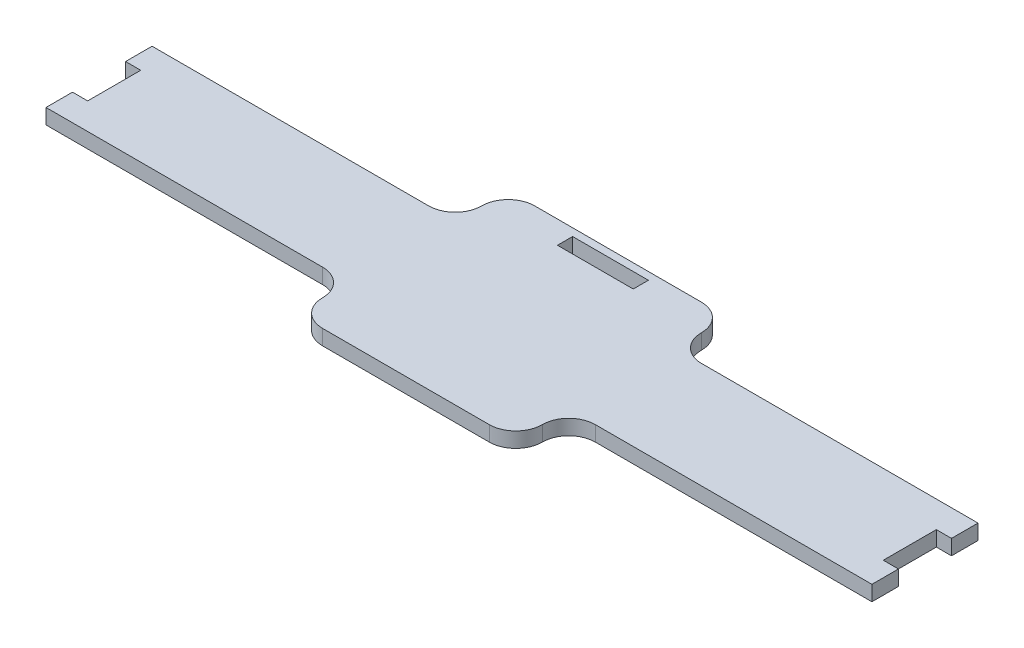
ISO-10303-21;
HEADER;
FILE_DESCRIPTION(('STEP AP214'),'2;1');
FILE_NAME('part.step','',(''),(''),'','','');
FILE_SCHEMA(('AUTOMOTIVE_DESIGN { 1 0 10303 214 1 1 1 1 }'));
ENDSEC;
DATA;
#1=APPLICATION_CONTEXT('core data for automotive mechanical design processes');
#2=APPLICATION_PROTOCOL_DEFINITION('international standard','automotive_design',2000,#1);
#3=PRODUCT_CONTEXT('',#1,'mechanical');
#4=PRODUCT('Part','Part','',(#3));
#5=PRODUCT_RELATED_PRODUCT_CATEGORY('part','',(#4));
#6=PRODUCT_DEFINITION_FORMATION('','',#4);
#7=PRODUCT_DEFINITION_CONTEXT('part definition',#1,'design');
#8=PRODUCT_DEFINITION('design','',#6,#7);
#9=PRODUCT_DEFINITION_SHAPE('','',#8);
#10=(LENGTH_UNIT() NAMED_UNIT(*) SI_UNIT(.MILLI.,.METRE.));
#11=(NAMED_UNIT(*) PLANE_ANGLE_UNIT() SI_UNIT($,.RADIAN.));
#12=(NAMED_UNIT(*) SI_UNIT($,.STERADIAN.) SOLID_ANGLE_UNIT());
#13=UNCERTAINTY_MEASURE_WITH_UNIT(LENGTH_MEASURE(1.E-05),#10,'distance_accuracy_value','');
#14=(GEOMETRIC_REPRESENTATION_CONTEXT(3) GLOBAL_UNCERTAINTY_ASSIGNED_CONTEXT((#13)) GLOBAL_UNIT_ASSIGNED_CONTEXT((#10,
#11,#12)) REPRESENTATION_CONTEXT('',''));
#15=CARTESIAN_POINT('',(0.,0.,0.));
#16=DIRECTION('',(0.,0.,1.));
#17=DIRECTION('',(1.,0.,0.));
#18=AXIS2_PLACEMENT_3D('',#15,#16,#17);
#19=CARTESIAN_POINT('',(0.,2.,0.));
#20=DIRECTION('',(0.,1.,0.));
#21=DIRECTION('',(0.,0.,1.));
#22=AXIS2_PLACEMENT_3D('',#19,#20,#21);
#23=PLANE('',#22);
#24=DIRECTION('',(-1.,0.,0.));
#25=VECTOR('',#24,1.);
#26=CARTESIAN_POINT('',(-5.,2.,-13.));
#27=LINE('',#26,#25);
#28=CARTESIAN_POINT('',(5.,2.,-13.));
#29=VERTEX_POINT('',#28);
#30=CARTESIAN_POINT('',(-5.,2.,-13.));
#31=VERTEX_POINT('',#30);
#32=EDGE_CURVE('E305',#29,#31,#27,.T.);
#33=ORIENTED_EDGE('',*,*,#32,.F.);
#34=DIRECTION('',(0.,0.,-1.));
#35=VECTOR('',#34,1.);
#36=CARTESIAN_POINT('',(4.99999999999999,2.,-11.));
#37=LINE('',#36,#35);
#38=CARTESIAN_POINT('',(4.99999999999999,2.,-11.));
#39=VERTEX_POINT('',#38);
#40=EDGE_CURVE('E302',#39,#29,#37,.T.);
#41=ORIENTED_EDGE('',*,*,#40,.F.);
#42=DIRECTION('',(1.,0.,0.));
#43=VECTOR('',#42,1.);
#44=CARTESIAN_POINT('',(-5.00000000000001,2.,-11.));
#45=LINE('',#44,#43);
#46=CARTESIAN_POINT('',(-5.00000000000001,2.,-11.));
#47=VERTEX_POINT('',#46);
#48=EDGE_CURVE('E313',#47,#39,#45,.T.);
#49=ORIENTED_EDGE('',*,*,#48,.F.);
#50=DIRECTION('',(0.,0.,1.));
#51=VECTOR('',#50,1.);
#52=CARTESIAN_POINT('',(-5.00000000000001,2.,-11.));
#53=LINE('',#52,#51);
#54=EDGE_CURVE('E309',#31,#47,#53,.T.);
#55=ORIENTED_EDGE('',*,*,#54,.F.);
#56=EDGE_LOOP('',(#33,#41,#49,#55));
#57=FACE_BOUND('',#56,.T.);
#58=DIRECTION('',(0.,0.,-1.));
#59=VECTOR('',#58,1.);
#60=CARTESIAN_POINT('',(-52.5,2.,3.5));
#61=LINE('',#60,#59);
#62=CARTESIAN_POINT('',(-52.5,2.,3.5));
#63=VERTEX_POINT('',#62);
#64=CARTESIAN_POINT('',(-52.5,2.,-3.5));
#65=VERTEX_POINT('',#64);
#66=EDGE_CURVE('E240',#63,#65,#61,.T.);
#67=ORIENTED_EDGE('',*,*,#66,.F.);
#68=DIRECTION('',(1.,0.,0.));
#69=VECTOR('',#68,1.);
#70=CARTESIAN_POINT('',(-54.5,2.,3.5));
#71=LINE('',#70,#69);
#72=CARTESIAN_POINT('',(-54.5,2.,3.5));
#73=VERTEX_POINT('',#72);
#74=EDGE_CURVE('E247',#73,#63,#71,.T.);
#75=ORIENTED_EDGE('',*,*,#74,.F.);
#76=DIRECTION('',(0.,0.,1.));
#77=VECTOR('',#76,1.);
#78=CARTESIAN_POINT('',(-54.5,2.,-6.99999999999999));
#79=LINE('',#78,#77);
#80=CARTESIAN_POINT('',(-54.5,2.,7.00000000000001));
#81=VERTEX_POINT('',#80);
#82=EDGE_CURVE('E355',#73,#81,#79,.T.);
#83=ORIENTED_EDGE('',*,*,#82,.T.);
#84=DIRECTION('',(1.,0.,0.));
#85=VECTOR('',#84,1.);
#86=CARTESIAN_POINT('',(-14.5,2.,7.00000000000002));
#87=LINE('',#86,#85);
#88=CARTESIAN_POINT('',(-18.,2.,7.00000000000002));
#89=VERTEX_POINT('',#88);
#90=EDGE_CURVE('E358',#81,#89,#87,.T.);
#91=ORIENTED_EDGE('',*,*,#90,.T.);
#92=CARTESIAN_POINT('',(-18.,2.,10.5));
#93=DIRECTION('',(0.,1.,0.));
#94=DIRECTION('',(0.,0.,1.));
#95=AXIS2_PLACEMENT_3D('',#92,#93,#94);
#96=CIRCLE('',#95,3.5);
#97=CARTESIAN_POINT('',(-14.5,2.,10.5));
#98=VERTEX_POINT('',#97);
#99=EDGE_CURVE('E491',#89,#98,#96,.F.);
#100=ORIENTED_EDGE('',*,*,#99,.T.);
#101=CARTESIAN_POINT('',(-11.,2.,10.5));
#102=DIRECTION('',(0.,1.,0.));
#103=DIRECTION('',(0.,0.,1.));
#104=AXIS2_PLACEMENT_3D('',#101,#102,#103);
#105=CIRCLE('',#104,3.5);
#106=CARTESIAN_POINT('',(-11.,2.,14.));
#107=VERTEX_POINT('',#106);
#108=EDGE_CURVE('E450',#98,#107,#105,.T.);
#109=ORIENTED_EDGE('',*,*,#108,.T.);
#110=DIRECTION('',(1.,0.,0.));
#111=VECTOR('',#110,1.);
#112=CARTESIAN_POINT('',(-14.5,2.,14.));
#113=LINE('',#112,#111);
#114=CARTESIAN_POINT('',(11.,2.,14.));
#115=VERTEX_POINT('',#114);
#116=EDGE_CURVE('E362',#107,#115,#113,.T.);
#117=ORIENTED_EDGE('',*,*,#116,.T.);
#118=CARTESIAN_POINT('',(11.,2.,10.5));
#119=DIRECTION('',(0.,1.,0.));
#120=DIRECTION('',(0.,0.,1.));
#121=AXIS2_PLACEMENT_3D('',#118,#119,#120);
#122=CIRCLE('',#121,3.5);
#123=CARTESIAN_POINT('',(14.5,2.,10.5));
#124=VERTEX_POINT('',#123);
#125=EDGE_CURVE('E447',#115,#124,#122,.T.);
#126=ORIENTED_EDGE('',*,*,#125,.T.);
#127=CARTESIAN_POINT('',(18.,2.,10.5));
#128=DIRECTION('',(0.,1.,0.));
#129=DIRECTION('',(0.,0.,1.));
#130=AXIS2_PLACEMENT_3D('',#127,#128,#129);
#131=CIRCLE('',#130,3.5);
#132=CARTESIAN_POINT('',(18.,2.,7.00000000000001));
#133=VERTEX_POINT('',#132);
#134=EDGE_CURVE('E11',#124,#133,#131,.F.);
#135=ORIENTED_EDGE('',*,*,#134,.T.);
#136=DIRECTION('',(1.,0.,0.));
#137=VECTOR('',#136,1.);
#138=CARTESIAN_POINT('',(14.5,2.,7.00000000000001));
#139=LINE('',#138,#137);
#140=CARTESIAN_POINT('',(54.5,2.,7.));
#141=VERTEX_POINT('',#140);
#142=EDGE_CURVE('E366',#133,#141,#139,.T.);
#143=ORIENTED_EDGE('',*,*,#142,.T.);
#144=DIRECTION('',(0.,0.,-1.));
#145=VECTOR('',#144,1.);
#146=CARTESIAN_POINT('',(54.5,2.,-7.));
#147=LINE('',#146,#145);
#148=CARTESIAN_POINT('',(54.5,2.,3.5));
#149=VERTEX_POINT('',#148);
#150=EDGE_CURVE('E370',#141,#149,#147,.T.);
#151=ORIENTED_EDGE('',*,*,#150,.T.);
#152=DIRECTION('',(1.,0.,0.));
#153=VECTOR('',#152,1.);
#154=CARTESIAN_POINT('',(54.5,2.,3.5));
#155=LINE('',#154,#153);
#156=CARTESIAN_POINT('',(52.5,2.,3.5));
#157=VERTEX_POINT('',#156);
#158=EDGE_CURVE('E287',#157,#149,#155,.T.);
#159=ORIENTED_EDGE('',*,*,#158,.F.);
#160=DIRECTION('',(0.,0.,1.));
#161=VECTOR('',#160,1.);
#162=CARTESIAN_POINT('',(52.5,2.,3.5));
#163=LINE('',#162,#161);
#164=CARTESIAN_POINT('',(52.5,2.,-3.5));
#165=VERTEX_POINT('',#164);
#166=EDGE_CURVE('E283',#165,#157,#163,.T.);
#167=ORIENTED_EDGE('',*,*,#166,.F.);
#168=DIRECTION('',(-1.,0.,0.));
#169=VECTOR('',#168,1.);
#170=CARTESIAN_POINT('',(54.5,2.,-3.5));
#171=LINE('',#170,#169);
#172=CARTESIAN_POINT('',(54.5,2.,-3.5));
#173=VERTEX_POINT('',#172);
#174=EDGE_CURVE('E290',#173,#165,#171,.T.);
#175=ORIENTED_EDGE('',*,*,#174,.F.);
#176=CARTESIAN_POINT('',(54.5,2.,-7.));
#177=VERTEX_POINT('',#176);
#178=EDGE_CURVE('E369',#173,#177,#147,.T.);
#179=ORIENTED_EDGE('',*,*,#178,.T.);
#180=DIRECTION('',(-1.,0.,0.));
#181=VECTOR('',#180,1.);
#182=CARTESIAN_POINT('',(14.5,2.,-7.));
#183=LINE('',#182,#181);
#184=CARTESIAN_POINT('',(18.,2.,-7.));
#185=VERTEX_POINT('',#184);
#186=EDGE_CURVE('E374',#177,#185,#183,.T.);
#187=ORIENTED_EDGE('',*,*,#186,.T.);
#188=CARTESIAN_POINT('',(18.,2.,-10.5));
#189=DIRECTION('',(0.,1.,0.));
#190=DIRECTION('',(0.,0.,1.));
#191=AXIS2_PLACEMENT_3D('',#188,#189,#190);
#192=CIRCLE('',#191,3.5);
#193=CARTESIAN_POINT('',(14.5,2.,-10.5));
#194=VERTEX_POINT('',#193);
#195=EDGE_CURVE('E485',#185,#194,#192,.F.);
#196=ORIENTED_EDGE('',*,*,#195,.T.);
#197=CARTESIAN_POINT('',(11.,2.,-10.5));
#198=DIRECTION('',(0.,1.,0.));
#199=DIRECTION('',(0.,0.,1.));
#200=AXIS2_PLACEMENT_3D('',#197,#198,#199);
#201=CIRCLE('',#200,3.5);
#202=CARTESIAN_POINT('',(11.,2.,-14.));
#203=VERTEX_POINT('',#202);
#204=EDGE_CURVE('E453',#194,#203,#201,.T.);
#205=ORIENTED_EDGE('',*,*,#204,.T.);
#206=DIRECTION('',(-1.,0.,0.));
#207=VECTOR('',#206,1.);
#208=CARTESIAN_POINT('',(-14.5,2.,-14.));
#209=LINE('',#208,#207);
#210=CARTESIAN_POINT('',(-11.,2.,-14.));
#211=VERTEX_POINT('',#210);
#212=EDGE_CURVE('E347',#203,#211,#209,.T.);
#213=ORIENTED_EDGE('',*,*,#212,.T.);
#214=CARTESIAN_POINT('',(-11.,2.,-10.5));
#215=DIRECTION('',(0.,1.,0.));
#216=DIRECTION('',(0.,0.,1.));
#217=AXIS2_PLACEMENT_3D('',#214,#215,#216);
#218=CIRCLE('',#217,3.5);
#219=CARTESIAN_POINT('',(-14.5,2.,-10.5));
#220=VERTEX_POINT('',#219);
#221=EDGE_CURVE('E456',#211,#220,#218,.T.);
#222=ORIENTED_EDGE('',*,*,#221,.T.);
#223=CARTESIAN_POINT('',(-18.,2.,-10.5));
#224=DIRECTION('',(0.,1.,0.));
#225=DIRECTION('',(0.,0.,1.));
#226=AXIS2_PLACEMENT_3D('',#223,#224,#225);
#227=CIRCLE('',#226,3.5);
#228=CARTESIAN_POINT('',(-18.,2.,-7.));
#229=VERTEX_POINT('',#228);
#230=EDGE_CURVE('E479',#220,#229,#227,.F.);
#231=ORIENTED_EDGE('',*,*,#230,.T.);
#232=DIRECTION('',(-1.,0.,0.));
#233=VECTOR('',#232,1.);
#234=CARTESIAN_POINT('',(-14.5,2.,-7.));
#235=LINE('',#234,#233);
#236=CARTESIAN_POINT('',(-54.5,2.,-6.99999999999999));
#237=VERTEX_POINT('',#236);
#238=EDGE_CURVE('E351',#229,#237,#235,.T.);
#239=ORIENTED_EDGE('',*,*,#238,.T.);
#240=CARTESIAN_POINT('',(-54.5,2.,-3.5));
#241=VERTEX_POINT('',#240);
#242=EDGE_CURVE('E251',#237,#241,#79,.T.);
#243=ORIENTED_EDGE('',*,*,#242,.T.);
#244=DIRECTION('',(-1.,0.,0.));
#245=VECTOR('',#244,1.);
#246=CARTESIAN_POINT('',(-54.5,2.,-3.5));
#247=LINE('',#246,#245);
#248=EDGE_CURVE('E61',#65,#241,#247,.T.);
#249=ORIENTED_EDGE('',*,*,#248,.F.);
#250=EDGE_LOOP('',(#67,#75,#83,#91,#100,#109,#117,#126,#135,#143,#151,#159,#167,#175,#179,#187,
#196,#205,#213,#222,#231,#239,#243,#249));
#251=FACE_BOUND('',#250,.T.);
#252=ADVANCED_FACE('F43',(#57,#251),#23,.T.);
#253=CARTESIAN_POINT('',(0.,0.,0.));
#254=DIRECTION('',(0.,1.,0.));
#255=DIRECTION('',(0.,0.,1.));
#256=AXIS2_PLACEMENT_3D('',#253,#254,#255);
#257=PLANE('',#256);
#258=DIRECTION('',(0.,0.,-1.));
#259=VECTOR('',#258,1.);
#260=CARTESIAN_POINT('',(4.99999999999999,0.,-11.));
#261=LINE('',#260,#259);
#262=CARTESIAN_POINT('',(4.99999999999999,0.,-11.));
#263=VERTEX_POINT('',#262);
#264=CARTESIAN_POINT('',(5.,0.,-13.));
#265=VERTEX_POINT('',#264);
#266=EDGE_CURVE('E317',#263,#265,#261,.T.);
#267=ORIENTED_EDGE('',*,*,#266,.T.);
#268=DIRECTION('',(-1.,0.,0.));
#269=VECTOR('',#268,1.);
#270=CARTESIAN_POINT('',(-5.,0.,-13.));
#271=LINE('',#270,#269);
#272=CARTESIAN_POINT('',(-5.,0.,-13.));
#273=VERTEX_POINT('',#272);
#274=EDGE_CURVE('E321',#265,#273,#271,.T.);
#275=ORIENTED_EDGE('',*,*,#274,.T.);
#276=DIRECTION('',(0.,0.,1.));
#277=VECTOR('',#276,1.);
#278=CARTESIAN_POINT('',(-5.00000000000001,0.,-11.));
#279=LINE('',#278,#277);
#280=CARTESIAN_POINT('',(-5.00000000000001,0.,-11.));
#281=VERTEX_POINT('',#280);
#282=EDGE_CURVE('E326',#273,#281,#279,.T.);
#283=ORIENTED_EDGE('',*,*,#282,.T.);
#284=DIRECTION('',(1.,0.,0.));
#285=VECTOR('',#284,1.);
#286=CARTESIAN_POINT('',(-5.00000000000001,0.,-11.));
#287=LINE('',#286,#285);
#288=EDGE_CURVE('E306',#281,#263,#287,.T.);
#289=ORIENTED_EDGE('',*,*,#288,.T.);
#290=EDGE_LOOP('',(#267,#275,#283,#289));
#291=FACE_BOUND('',#290,.T.);
#292=DIRECTION('',(1.,0.,0.));
#293=VECTOR('',#292,1.);
#294=CARTESIAN_POINT('',(-54.5,0.,3.5));
#295=LINE('',#294,#293);
#296=CARTESIAN_POINT('',(-54.5,0.,3.5));
#297=VERTEX_POINT('',#296);
#298=CARTESIAN_POINT('',(-52.5,0.,3.5));
#299=VERTEX_POINT('',#298);
#300=EDGE_CURVE('E263',#297,#299,#295,.T.);
#301=ORIENTED_EDGE('',*,*,#300,.T.);
#302=DIRECTION('',(0.,0.,-1.));
#303=VECTOR('',#302,1.);
#304=CARTESIAN_POINT('',(-52.5,0.,3.5));
#305=LINE('',#304,#303);
#306=CARTESIAN_POINT('',(-52.5,0.,-3.5));
#307=VERTEX_POINT('',#306);
#308=EDGE_CURVE('E237',#299,#307,#305,.T.);
#309=ORIENTED_EDGE('',*,*,#308,.T.);
#310=DIRECTION('',(-1.,0.,0.));
#311=VECTOR('',#310,1.);
#312=CARTESIAN_POINT('',(-54.5,0.,-3.5));
#313=LINE('',#312,#311);
#314=CARTESIAN_POINT('',(-54.5,0.,-3.5));
#315=VERTEX_POINT('',#314);
#316=EDGE_CURVE('E232',#307,#315,#313,.T.);
#317=ORIENTED_EDGE('',*,*,#316,.T.);
#318=DIRECTION('',(0.,0.,1.));
#319=VECTOR('',#318,1.);
#320=CARTESIAN_POINT('',(-54.5,0.,-6.99999999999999));
#321=LINE('',#320,#319);
#322=CARTESIAN_POINT('',(-54.5,0.,-6.99999999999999));
#323=VERTEX_POINT('',#322);
#324=EDGE_CURVE('E386',#323,#315,#321,.T.);
#325=ORIENTED_EDGE('',*,*,#324,.F.);
#326=DIRECTION('',(-1.,0.,0.));
#327=VECTOR('',#326,1.);
#328=CARTESIAN_POINT('',(-14.5,0.,-7.));
#329=LINE('',#328,#327);
#330=CARTESIAN_POINT('',(-18.,0.,-7.));
#331=VERTEX_POINT('',#330);
#332=EDGE_CURVE('E382',#331,#323,#329,.T.);
#333=ORIENTED_EDGE('',*,*,#332,.F.);
#334=CARTESIAN_POINT('',(-18.,0.,-10.5));
#335=DIRECTION('',(0.,1.,0.));
#336=DIRECTION('',(0.,0.,1.));
#337=AXIS2_PLACEMENT_3D('',#334,#335,#336);
#338=CIRCLE('',#337,3.5);
#339=CARTESIAN_POINT('',(-14.5,0.,-10.5));
#340=VERTEX_POINT('',#339);
#341=EDGE_CURVE('E476',#331,#340,#338,.T.);
#342=ORIENTED_EDGE('',*,*,#341,.T.);
#343=CARTESIAN_POINT('',(-11.,0.,-10.5));
#344=DIRECTION('',(0.,1.,0.));
#345=DIRECTION('',(0.,0.,1.));
#346=AXIS2_PLACEMENT_3D('',#343,#344,#345);
#347=CIRCLE('',#346,3.5);
#348=CARTESIAN_POINT('',(-11.,0.,-14.));
#349=VERTEX_POINT('',#348);
#350=EDGE_CURVE('E437',#340,#349,#347,.F.);
#351=ORIENTED_EDGE('',*,*,#350,.T.);
#352=DIRECTION('',(-1.,0.,0.));
#353=VECTOR('',#352,1.);
#354=CARTESIAN_POINT('',(-14.5,0.,-14.));
#355=LINE('',#354,#353);
#356=CARTESIAN_POINT('',(11.,0.,-14.));
#357=VERTEX_POINT('',#356);
#358=EDGE_CURVE('E346',#357,#349,#355,.T.);
#359=ORIENTED_EDGE('',*,*,#358,.F.);
#360=CARTESIAN_POINT('',(11.,0.,-10.5));
#361=DIRECTION('',(0.,1.,0.));
#362=DIRECTION('',(0.,0.,1.));
#363=AXIS2_PLACEMENT_3D('',#360,#361,#362);
#364=CIRCLE('',#363,3.5);
#365=CARTESIAN_POINT('',(14.5,0.,-10.5));
#366=VERTEX_POINT('',#365);
#367=EDGE_CURVE('E434',#357,#366,#364,.F.);
#368=ORIENTED_EDGE('',*,*,#367,.T.);
#369=CARTESIAN_POINT('',(18.,0.,-10.5));
#370=DIRECTION('',(0.,1.,0.));
#371=DIRECTION('',(0.,0.,1.));
#372=AXIS2_PLACEMENT_3D('',#369,#370,#371);
#373=CIRCLE('',#372,3.5);
#374=CARTESIAN_POINT('',(18.,0.,-7.));
#375=VERTEX_POINT('',#374);
#376=EDGE_CURVE('E482',#366,#375,#373,.T.);
#377=ORIENTED_EDGE('',*,*,#376,.T.);
#378=DIRECTION('',(-1.,0.,0.));
#379=VECTOR('',#378,1.);
#380=CARTESIAN_POINT('',(14.5,0.,-7.));
#381=LINE('',#380,#379);
#382=CARTESIAN_POINT('',(54.5,0.,-7.));
#383=VERTEX_POINT('',#382);
#384=EDGE_CURVE('E352',#383,#375,#381,.T.);
#385=ORIENTED_EDGE('',*,*,#384,.F.);
#386=DIRECTION('',(0.,0.,-1.));
#387=VECTOR('',#386,1.);
#388=CARTESIAN_POINT('',(54.5,0.,-7.));
#389=LINE('',#388,#387);
#390=CARTESIAN_POINT('',(54.5,0.,-3.5));
#391=VERTEX_POINT('',#390);
#392=EDGE_CURVE('E401',#391,#383,#389,.T.);
#393=ORIENTED_EDGE('',*,*,#392,.F.);
#394=DIRECTION('',(-1.,0.,0.));
#395=VECTOR('',#394,1.);
#396=CARTESIAN_POINT('',(54.5,0.,-3.5));
#397=LINE('',#396,#395);
#398=CARTESIAN_POINT('',(52.5,0.,-3.5));
#399=VERTEX_POINT('',#398);
#400=EDGE_CURVE('E69',#391,#399,#397,.T.);
#401=ORIENTED_EDGE('',*,*,#400,.T.);
#402=DIRECTION('',(0.,0.,1.));
#403=VECTOR('',#402,1.);
#404=CARTESIAN_POINT('',(52.5,0.,3.5));
#405=LINE('',#404,#403);
#406=CARTESIAN_POINT('',(52.5,0.,3.5));
#407=VERTEX_POINT('',#406);
#408=EDGE_CURVE('E276',#399,#407,#405,.T.);
#409=ORIENTED_EDGE('',*,*,#408,.T.);
#410=DIRECTION('',(1.,0.,0.));
#411=VECTOR('',#410,1.);
#412=CARTESIAN_POINT('',(54.5,0.,3.5));
#413=LINE('',#412,#411);
#414=CARTESIAN_POINT('',(54.5,0.,3.5));
#415=VERTEX_POINT('',#414);
#416=EDGE_CURVE('E272',#407,#415,#413,.T.);
#417=ORIENTED_EDGE('',*,*,#416,.T.);
#418=CARTESIAN_POINT('',(54.5,0.,7.));
#419=VERTEX_POINT('',#418);
#420=EDGE_CURVE('E402',#419,#415,#389,.T.);
#421=ORIENTED_EDGE('',*,*,#420,.F.);
#422=DIRECTION('',(1.,0.,0.));
#423=VECTOR('',#422,1.);
#424=CARTESIAN_POINT('',(14.5,0.,7.00000000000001));
#425=LINE('',#424,#423);
#426=CARTESIAN_POINT('',(18.,0.,7.00000000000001));
#427=VERTEX_POINT('',#426);
#428=EDGE_CURVE('E398',#427,#419,#425,.T.);
#429=ORIENTED_EDGE('',*,*,#428,.F.);
#430=CARTESIAN_POINT('',(18.,0.,10.5));
#431=DIRECTION('',(0.,1.,0.));
#432=DIRECTION('',(0.,0.,1.));
#433=AXIS2_PLACEMENT_3D('',#430,#431,#432);
#434=CIRCLE('',#433,3.5);
#435=CARTESIAN_POINT('',(14.5,0.,10.5));
#436=VERTEX_POINT('',#435);
#437=EDGE_CURVE('E53',#427,#436,#434,.T.);
#438=ORIENTED_EDGE('',*,*,#437,.T.);
#439=CARTESIAN_POINT('',(11.,0.,10.5));
#440=DIRECTION('',(0.,1.,0.));
#441=DIRECTION('',(0.,0.,1.));
#442=AXIS2_PLACEMENT_3D('',#439,#440,#441);
#443=CIRCLE('',#442,3.5);
#444=CARTESIAN_POINT('',(11.,0.,14.));
#445=VERTEX_POINT('',#444);
#446=EDGE_CURVE('E428',#436,#445,#443,.F.);
#447=ORIENTED_EDGE('',*,*,#446,.T.);
#448=DIRECTION('',(1.,0.,0.));
#449=VECTOR('',#448,1.);
#450=CARTESIAN_POINT('',(-14.5,0.,14.));
#451=LINE('',#450,#449);
#452=CARTESIAN_POINT('',(-11.,0.,14.));
#453=VERTEX_POINT('',#452);
#454=EDGE_CURVE('E394',#453,#445,#451,.T.);
#455=ORIENTED_EDGE('',*,*,#454,.F.);
#456=CARTESIAN_POINT('',(-11.,0.,10.5));
#457=DIRECTION('',(0.,1.,0.));
#458=DIRECTION('',(0.,0.,1.));
#459=AXIS2_PLACEMENT_3D('',#456,#457,#458);
#460=CIRCLE('',#459,3.5);
#461=CARTESIAN_POINT('',(-14.5,0.,10.5));
#462=VERTEX_POINT('',#461);
#463=EDGE_CURVE('E431',#453,#462,#460,.F.);
#464=ORIENTED_EDGE('',*,*,#463,.T.);
#465=CARTESIAN_POINT('',(-18.,0.,10.5));
#466=DIRECTION('',(0.,1.,0.));
#467=DIRECTION('',(0.,0.,1.));
#468=AXIS2_PLACEMENT_3D('',#465,#466,#467);
#469=CIRCLE('',#468,3.5);
#470=CARTESIAN_POINT('',(-18.,0.,7.00000000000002));
#471=VERTEX_POINT('',#470);
#472=EDGE_CURVE('E488',#462,#471,#469,.T.);
#473=ORIENTED_EDGE('',*,*,#472,.T.);
#474=DIRECTION('',(1.,0.,0.));
#475=VECTOR('',#474,1.);
#476=CARTESIAN_POINT('',(-14.5,0.,7.00000000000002));
#477=LINE('',#476,#475);
#478=CARTESIAN_POINT('',(-54.5,0.,7.00000000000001));
#479=VERTEX_POINT('',#478);
#480=EDGE_CURVE('E390',#479,#471,#477,.T.);
#481=ORIENTED_EDGE('',*,*,#480,.F.);
#482=EDGE_CURVE('E385',#297,#479,#321,.T.);
#483=ORIENTED_EDGE('',*,*,#482,.F.);
#484=EDGE_LOOP('',(#301,#309,#317,#325,#333,#342,#351,#359,#368,#377,#385,#393,#401,#409,#417,
#421,#429,#438,#447,#455,#464,#473,#481,#483));
#485=FACE_BOUND('',#484,.T.);
#486=ADVANCED_FACE('F561',(#291,#485),#257,.F.);
#487=CARTESIAN_POINT('',(-54.5,2.,-6.99999999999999));
#488=DIRECTION('',(1.,0.,0.));
#489=DIRECTION('',(0.,0.,-1.));
#490=AXIS2_PLACEMENT_3D('',#487,#488,#489);
#491=PLANE('',#490);
#492=DIRECTION('',(0.,-1.,0.));
#493=VECTOR('',#492,1.);
#494=CARTESIAN_POINT('',(-54.5,9.28010988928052,3.5));
#495=LINE('',#494,#493);
#496=EDGE_CURVE('E259',#73,#297,#495,.T.);
#497=ORIENTED_EDGE('',*,*,#496,.T.);
#498=ORIENTED_EDGE('',*,*,#482,.T.);
#499=DIRECTION('',(0.,-1.,0.));
#500=VECTOR('',#499,1.);
#501=CARTESIAN_POINT('',(-54.5,2.,7.00000000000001));
#502=LINE('',#501,#500);
#503=EDGE_CURVE('E416',#81,#479,#502,.T.);
#504=ORIENTED_EDGE('',*,*,#503,.F.);
#505=ORIENTED_EDGE('',*,*,#82,.F.);
#506=EDGE_LOOP('',(#497,#498,#504,#505));
#507=FACE_BOUND('',#506,.T.);
#508=ADVANCED_FACE('F552',(#507),#491,.F.);
#509=DIRECTION('',(0.,-1.,0.));
#510=VECTOR('',#509,1.);
#511=CARTESIAN_POINT('',(-54.5,9.28010988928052,-3.5));
#512=LINE('',#511,#510);
#513=EDGE_CURVE('E264',#241,#315,#512,.T.);
#514=ORIENTED_EDGE('',*,*,#513,.F.);
#515=ORIENTED_EDGE('',*,*,#242,.F.);
#516=DIRECTION('',(0.,-1.,0.));
#517=VECTOR('',#516,1.);
#518=CARTESIAN_POINT('',(-54.5,2.,-6.99999999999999));
#519=LINE('',#518,#517);
#520=EDGE_CURVE('E420',#237,#323,#519,.T.);
#521=ORIENTED_EDGE('',*,*,#520,.T.);
#522=ORIENTED_EDGE('',*,*,#324,.T.);
#523=EDGE_LOOP('',(#514,#515,#521,#522));
#524=FACE_BOUND('',#523,.T.);
#525=ADVANCED_FACE('F575',(#524),#491,.F.);
#526=CARTESIAN_POINT('',(54.5,2.,-7.));
#527=DIRECTION('',(-1.,0.,0.));
#528=DIRECTION('',(0.,0.,1.));
#529=AXIS2_PLACEMENT_3D('',#526,#527,#528);
#530=PLANE('',#529);
#531=DIRECTION('',(0.,-1.,0.));
#532=VECTOR('',#531,1.);
#533=CARTESIAN_POINT('',(54.5,9.28010988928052,3.5));
#534=LINE('',#533,#532);
#535=EDGE_CURVE('E280',#149,#415,#534,.T.);
#536=ORIENTED_EDGE('',*,*,#535,.F.);
#537=ORIENTED_EDGE('',*,*,#150,.F.);
#538=DIRECTION('',(0.,-1.,0.));
#539=VECTOR('',#538,1.);
#540=CARTESIAN_POINT('',(54.5,2.,7.));
#541=LINE('',#540,#539);
#542=EDGE_CURVE('E412',#141,#419,#541,.T.);
#543=ORIENTED_EDGE('',*,*,#542,.T.);
#544=ORIENTED_EDGE('',*,*,#420,.T.);
#545=EDGE_LOOP('',(#536,#537,#543,#544));
#546=FACE_BOUND('',#545,.T.);
#547=ADVANCED_FACE('F528',(#546),#530,.F.);
#548=DIRECTION('',(0.,-1.,0.));
#549=VECTOR('',#548,1.);
#550=CARTESIAN_POINT('',(54.5,9.28010988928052,-3.5));
#551=LINE('',#550,#549);
#552=EDGE_CURVE('E277',#173,#391,#551,.T.);
#553=ORIENTED_EDGE('',*,*,#552,.T.);
#554=ORIENTED_EDGE('',*,*,#392,.T.);
#555=DIRECTION('',(0.,-1.,0.));
#556=VECTOR('',#555,1.);
#557=CARTESIAN_POINT('',(54.5,2.,-7.));
#558=LINE('',#557,#556);
#559=EDGE_CURVE('E378',#177,#383,#558,.T.);
#560=ORIENTED_EDGE('',*,*,#559,.F.);
#561=ORIENTED_EDGE('',*,*,#178,.F.);
#562=EDGE_LOOP('',(#553,#554,#560,#561));
#563=FACE_BOUND('',#562,.T.);
#564=ADVANCED_FACE('F542',(#563),#530,.F.);
#565=CARTESIAN_POINT('',(-14.5,2.,-14.));
#566=DIRECTION('',(0.,0.,1.));
#567=DIRECTION('',(1.,0.,0.));
#568=AXIS2_PLACEMENT_3D('',#565,#566,#567);
#569=PLANE('',#568);
#570=ORIENTED_EDGE('',*,*,#358,.T.);
#571=DIRECTION('',(0.,-1.,0.));
#572=VECTOR('',#571,1.);
#573=CARTESIAN_POINT('',(-11.,2.,-14.));
#574=LINE('',#573,#572);
#575=EDGE_CURVE('E444',#349,#211,#574,.F.);
#576=ORIENTED_EDGE('',*,*,#575,.T.);
#577=ORIENTED_EDGE('',*,*,#212,.F.);
#578=DIRECTION('',(0.,-1.,0.));
#579=VECTOR('',#578,1.);
#580=CARTESIAN_POINT('',(11.,2.,-14.));
#581=LINE('',#580,#579);
#582=EDGE_CURVE('E440',#203,#357,#581,.T.);
#583=ORIENTED_EDGE('',*,*,#582,.T.);
#584=EDGE_LOOP('',(#570,#576,#577,#583));
#585=FACE_BOUND('',#584,.T.);
#586=ADVANCED_FACE('F595',(#585),#569,.F.);
#587=CARTESIAN_POINT('',(-14.5,2.,-7.));
#588=DIRECTION('',(0.,0.,1.));
#589=DIRECTION('',(1.,0.,0.));
#590=AXIS2_PLACEMENT_3D('',#587,#588,#589);
#591=PLANE('',#590);
#592=ORIENTED_EDGE('',*,*,#238,.F.);
#593=DIRECTION('',(0.,-1.,0.));
#594=VECTOR('',#593,1.);
#595=CARTESIAN_POINT('',(-18.,0.,-7.));
#596=LINE('',#595,#594);
#597=EDGE_CURVE('E424',#229,#331,#596,.T.);
#598=ORIENTED_EDGE('',*,*,#597,.T.);
#599=ORIENTED_EDGE('',*,*,#332,.T.);
#600=ORIENTED_EDGE('',*,*,#520,.F.);
#601=EDGE_LOOP('',(#592,#598,#599,#600));
#602=FACE_BOUND('',#601,.T.);
#603=ADVANCED_FACE('F579',(#602),#591,.F.);
#604=CARTESIAN_POINT('',(-14.5,2.,7.00000000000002));
#605=DIRECTION('',(0.,0.,-1.));
#606=DIRECTION('',(-1.,0.,0.));
#607=AXIS2_PLACEMENT_3D('',#604,#605,#606);
#608=PLANE('',#607);
#609=ORIENTED_EDGE('',*,*,#480,.T.);
#610=DIRECTION('',(0.,-1.,0.));
#611=VECTOR('',#610,1.);
#612=CARTESIAN_POINT('',(-18.,2.,7.00000000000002));
#613=LINE('',#612,#611);
#614=EDGE_CURVE('E462',#471,#89,#613,.F.);
#615=ORIENTED_EDGE('',*,*,#614,.T.);
#616=ORIENTED_EDGE('',*,*,#90,.F.);
#617=ORIENTED_EDGE('',*,*,#503,.T.);
#618=EDGE_LOOP('',(#609,#615,#616,#617));
#619=FACE_BOUND('',#618,.T.);
#620=ADVANCED_FACE('F559',(#619),#608,.F.);
#621=CARTESIAN_POINT('',(-14.5,2.,14.));
#622=DIRECTION('',(0.,0.,-1.));
#623=DIRECTION('',(-1.,0.,0.));
#624=AXIS2_PLACEMENT_3D('',#621,#622,#623);
#625=PLANE('',#624);
#626=ORIENTED_EDGE('',*,*,#116,.F.);
#627=DIRECTION('',(0.,-1.,0.));
#628=VECTOR('',#627,1.);
#629=CARTESIAN_POINT('',(-11.,2.,14.));
#630=LINE('',#629,#628);
#631=EDGE_CURVE('E470',#107,#453,#630,.T.);
#632=ORIENTED_EDGE('',*,*,#631,.T.);
#633=ORIENTED_EDGE('',*,*,#454,.T.);
#634=DIRECTION('',(0.,-1.,0.));
#635=VECTOR('',#634,1.);
#636=CARTESIAN_POINT('',(11.,2.,14.));
#637=LINE('',#636,#635);
#638=EDGE_CURVE('E466',#445,#115,#637,.F.);
#639=ORIENTED_EDGE('',*,*,#638,.T.);
#640=EDGE_LOOP('',(#626,#632,#633,#639));
#641=FACE_BOUND('',#640,.T.);
#642=ADVANCED_FACE('F609',(#641),#625,.F.);
#643=CARTESIAN_POINT('',(14.5,2.,7.00000000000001));
#644=DIRECTION('',(0.,0.,-1.));
#645=DIRECTION('',(-1.,0.,0.));
#646=AXIS2_PLACEMENT_3D('',#643,#644,#645);
#647=PLANE('',#646);
#648=ORIENTED_EDGE('',*,*,#142,.F.);
#649=DIRECTION('',(0.,-1.,0.));
#650=VECTOR('',#649,1.);
#651=CARTESIAN_POINT('',(18.,0.,7.00000000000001));
#652=LINE('',#651,#650);
#653=EDGE_CURVE('E473',#133,#427,#652,.T.);
#654=ORIENTED_EDGE('',*,*,#653,.T.);
#655=ORIENTED_EDGE('',*,*,#428,.T.);
#656=ORIENTED_EDGE('',*,*,#542,.F.);
#657=EDGE_LOOP('',(#648,#654,#655,#656));
#658=FACE_BOUND('',#657,.T.);
#659=ADVANCED_FACE('F522',(#658),#647,.F.);
#660=CARTESIAN_POINT('',(14.5,2.,-7.));
#661=DIRECTION('',(0.,0.,1.));
#662=DIRECTION('',(1.,0.,0.));
#663=AXIS2_PLACEMENT_3D('',#660,#661,#662);
#664=PLANE('',#663);
#665=ORIENTED_EDGE('',*,*,#384,.T.);
#666=DIRECTION('',(0.,-1.,0.));
#667=VECTOR('',#666,1.);
#668=CARTESIAN_POINT('',(18.,2.,-7.));
#669=LINE('',#668,#667);
#670=EDGE_CURVE('E459',#375,#185,#669,.F.);
#671=ORIENTED_EDGE('',*,*,#670,.T.);
#672=ORIENTED_EDGE('',*,*,#186,.F.);
#673=ORIENTED_EDGE('',*,*,#559,.T.);
#674=EDGE_LOOP('',(#665,#671,#672,#673));
#675=FACE_BOUND('',#674,.T.);
#676=ADVANCED_FACE('F606',(#675),#664,.F.);
#677=CARTESIAN_POINT('',(4.99999999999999,2.,-11.));
#678=DIRECTION('',(-1.,0.,0.));
#679=DIRECTION('',(0.,0.,1.));
#680=AXIS2_PLACEMENT_3D('',#677,#678,#679);
#681=PLANE('',#680);
#682=ORIENTED_EDGE('',*,*,#266,.F.);
#683=DIRECTION('',(0.,-1.,0.));
#684=VECTOR('',#683,1.);
#685=CARTESIAN_POINT('',(4.99999999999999,2.,-11.));
#686=LINE('',#685,#684);
#687=EDGE_CURVE('E316',#39,#263,#686,.T.);
#688=ORIENTED_EDGE('',*,*,#687,.F.);
#689=ORIENTED_EDGE('',*,*,#40,.T.);
#690=DIRECTION('',(0.,-1.,0.));
#691=VECTOR('',#690,1.);
#692=CARTESIAN_POINT('',(5.,2.,-13.));
#693=LINE('',#692,#691);
#694=EDGE_CURVE('E342',#29,#265,#693,.T.);
#695=ORIENTED_EDGE('',*,*,#694,.T.);
#696=EDGE_LOOP('',(#682,#688,#689,#695));
#697=FACE_BOUND('',#696,.T.);
#698=ADVANCED_FACE('F631',(#697),#681,.T.);
#699=CARTESIAN_POINT('',(-5.,2.,-13.));
#700=DIRECTION('',(0.,0.,1.));
#701=DIRECTION('',(1.,0.,0.));
#702=AXIS2_PLACEMENT_3D('',#699,#700,#701);
#703=PLANE('',#702);
#704=ORIENTED_EDGE('',*,*,#274,.F.);
#705=ORIENTED_EDGE('',*,*,#694,.F.);
#706=ORIENTED_EDGE('',*,*,#32,.T.);
#707=DIRECTION('',(0.,-1.,0.));
#708=VECTOR('',#707,1.);
#709=CARTESIAN_POINT('',(-5.,2.,-13.));
#710=LINE('',#709,#708);
#711=EDGE_CURVE('E339',#31,#273,#710,.T.);
#712=ORIENTED_EDGE('',*,*,#711,.T.);
#713=EDGE_LOOP('',(#704,#705,#706,#712));
#714=FACE_BOUND('',#713,.T.);
#715=ADVANCED_FACE('F803',(#714),#703,.T.);
#716=CARTESIAN_POINT('',(-5.00000000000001,2.,-11.));
#717=DIRECTION('',(1.,0.,0.));
#718=DIRECTION('',(0.,0.,-1.));
#719=AXIS2_PLACEMENT_3D('',#716,#717,#718);
#720=PLANE('',#719);
#721=ORIENTED_EDGE('',*,*,#282,.F.);
#722=ORIENTED_EDGE('',*,*,#711,.F.);
#723=ORIENTED_EDGE('',*,*,#54,.T.);
#724=DIRECTION('',(0.,-1.,0.));
#725=VECTOR('',#724,1.);
#726=CARTESIAN_POINT('',(-5.00000000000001,2.,-11.));
#727=LINE('',#726,#725);
#728=EDGE_CURVE('E336',#47,#281,#727,.T.);
#729=ORIENTED_EDGE('',*,*,#728,.T.);
#730=EDGE_LOOP('',(#721,#722,#723,#729));
#731=FACE_BOUND('',#730,.T.);
#732=ADVANCED_FACE('F800',(#731),#720,.T.);
#733=CARTESIAN_POINT('',(-5.00000000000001,2.,-11.));
#734=DIRECTION('',(0.,0.,-1.));
#735=DIRECTION('',(-1.,0.,0.));
#736=AXIS2_PLACEMENT_3D('',#733,#734,#735);
#737=PLANE('',#736);
#738=ORIENTED_EDGE('',*,*,#288,.F.);
#739=ORIENTED_EDGE('',*,*,#728,.F.);
#740=ORIENTED_EDGE('',*,*,#48,.T.);
#741=ORIENTED_EDGE('',*,*,#687,.T.);
#742=EDGE_LOOP('',(#738,#739,#740,#741));
#743=FACE_BOUND('',#742,.T.);
#744=ADVANCED_FACE('F653',(#743),#737,.T.);
#745=CARTESIAN_POINT('',(-11.,2.,-10.5));
#746=DIRECTION('',(0.,-1.,0.));
#747=DIRECTION('',(0.,0.,-1.));
#748=AXIS2_PLACEMENT_3D('',#745,#746,#747);
#749=CYLINDRICAL_SURFACE('',#748,3.5);
#750=DIRECTION('',(0.,-1.,0.));
#751=VECTOR('',#750,1.);
#752=CARTESIAN_POINT('',(-14.5,2.,-10.5));
#753=LINE('',#752,#751);
#754=EDGE_CURVE('E322',#220,#340,#753,.T.);
#755=ORIENTED_EDGE('',*,*,#754,.F.);
#756=ORIENTED_EDGE('',*,*,#221,.F.);
#757=ORIENTED_EDGE('',*,*,#575,.F.);
#758=ORIENTED_EDGE('',*,*,#350,.F.);
#759=EDGE_LOOP('',(#755,#756,#757,#758));
#760=FACE_BOUND('',#759,.T.);
#761=ADVANCED_FACE('F587',(#760),#749,.T.);
#762=CARTESIAN_POINT('',(-18.,2.,-10.5));
#763=DIRECTION('',(0.,1.,0.));
#764=DIRECTION('',(0.,0.,1.));
#765=AXIS2_PLACEMENT_3D('',#762,#763,#764);
#766=CYLINDRICAL_SURFACE('',#765,3.5);
#767=ORIENTED_EDGE('',*,*,#230,.F.);
#768=ORIENTED_EDGE('',*,*,#754,.T.);
#769=ORIENTED_EDGE('',*,*,#341,.F.);
#770=ORIENTED_EDGE('',*,*,#597,.F.);
#771=EDGE_LOOP('',(#767,#768,#769,#770));
#772=FACE_BOUND('',#771,.T.);
#773=ADVANCED_FACE('F590',(#772),#766,.F.);
#774=CARTESIAN_POINT('',(18.,2.,-10.5));
#775=DIRECTION('',(0.,1.,0.));
#776=DIRECTION('',(0.,0.,1.));
#777=AXIS2_PLACEMENT_3D('',#774,#775,#776);
#778=CYLINDRICAL_SURFACE('',#777,3.5);
#779=DIRECTION('',(0.,-1.,0.));
#780=VECTOR('',#779,1.);
#781=CARTESIAN_POINT('',(14.5,0.,-10.5));
#782=LINE('',#781,#780);
#783=EDGE_CURVE('E499',#194,#366,#782,.T.);
#784=ORIENTED_EDGE('',*,*,#783,.F.);
#785=ORIENTED_EDGE('',*,*,#195,.F.);
#786=ORIENTED_EDGE('',*,*,#670,.F.);
#787=ORIENTED_EDGE('',*,*,#376,.F.);
#788=EDGE_LOOP('',(#784,#785,#786,#787));
#789=FACE_BOUND('',#788,.T.);
#790=ADVANCED_FACE('F603',(#789),#778,.F.);
#791=CARTESIAN_POINT('',(11.,2.,-10.5));
#792=DIRECTION('',(0.,-1.,0.));
#793=DIRECTION('',(0.,0.,-1.));
#794=AXIS2_PLACEMENT_3D('',#791,#792,#793);
#795=CYLINDRICAL_SURFACE('',#794,3.5);
#796=ORIENTED_EDGE('',*,*,#204,.F.);
#797=ORIENTED_EDGE('',*,*,#783,.T.);
#798=ORIENTED_EDGE('',*,*,#367,.F.);
#799=ORIENTED_EDGE('',*,*,#582,.F.);
#800=EDGE_LOOP('',(#796,#797,#798,#799));
#801=FACE_BOUND('',#800,.T.);
#802=ADVANCED_FACE('F597',(#801),#795,.T.);
#803=CARTESIAN_POINT('',(-11.,2.,10.5));
#804=DIRECTION('',(0.,-1.,0.));
#805=DIRECTION('',(0.,0.,-1.));
#806=AXIS2_PLACEMENT_3D('',#803,#804,#805);
#807=CYLINDRICAL_SURFACE('',#806,3.5);
#808=ORIENTED_EDGE('',*,*,#631,.F.);
#809=ORIENTED_EDGE('',*,*,#108,.F.);
#810=DIRECTION('',(0.,-1.,0.));
#811=VECTOR('',#810,1.);
#812=CARTESIAN_POINT('',(-14.5,2.,10.5));
#813=LINE('',#812,#811);
#814=EDGE_CURVE('E502',#462,#98,#813,.F.);
#815=ORIENTED_EDGE('',*,*,#814,.F.);
#816=ORIENTED_EDGE('',*,*,#463,.F.);
#817=EDGE_LOOP('',(#808,#809,#815,#816));
#818=FACE_BOUND('',#817,.T.);
#819=ADVANCED_FACE('F612',(#818),#807,.T.);
#820=CARTESIAN_POINT('',(-18.,2.,10.5));
#821=DIRECTION('',(0.,1.,0.));
#822=DIRECTION('',(0.,0.,1.));
#823=AXIS2_PLACEMENT_3D('',#820,#821,#822);
#824=CYLINDRICAL_SURFACE('',#823,3.5);
#825=ORIENTED_EDGE('',*,*,#99,.F.);
#826=ORIENTED_EDGE('',*,*,#614,.F.);
#827=ORIENTED_EDGE('',*,*,#472,.F.);
#828=ORIENTED_EDGE('',*,*,#814,.T.);
#829=EDGE_LOOP('',(#825,#826,#827,#828));
#830=FACE_BOUND('',#829,.T.);
#831=ADVANCED_FACE('F564',(#830),#824,.F.);
#832=CARTESIAN_POINT('',(18.,2.,10.5));
#833=DIRECTION('',(0.,1.,0.));
#834=DIRECTION('',(0.,0.,1.));
#835=AXIS2_PLACEMENT_3D('',#832,#833,#834);
#836=CYLINDRICAL_SURFACE('',#835,3.5);
#837=ORIENTED_EDGE('',*,*,#653,.F.);
#838=ORIENTED_EDGE('',*,*,#134,.F.);
#839=DIRECTION('',(0.,-1.,0.));
#840=VECTOR('',#839,1.);
#841=CARTESIAN_POINT('',(14.5,2.,10.5));
#842=LINE('',#841,#840);
#843=EDGE_CURVE('E47',#436,#124,#842,.F.);
#844=ORIENTED_EDGE('',*,*,#843,.F.);
#845=ORIENTED_EDGE('',*,*,#437,.F.);
#846=EDGE_LOOP('',(#837,#838,#844,#845));
#847=FACE_BOUND('',#846,.T.);
#848=ADVANCED_FACE('F45',(#847),#836,.F.);
#849=CARTESIAN_POINT('',(11.,2.,10.5));
#850=DIRECTION('',(0.,-1.,0.));
#851=DIRECTION('',(0.,0.,-1.));
#852=AXIS2_PLACEMENT_3D('',#849,#850,#851);
#853=CYLINDRICAL_SURFACE('',#852,3.5);
#854=ORIENTED_EDGE('',*,*,#125,.F.);
#855=ORIENTED_EDGE('',*,*,#638,.F.);
#856=ORIENTED_EDGE('',*,*,#446,.F.);
#857=ORIENTED_EDGE('',*,*,#843,.T.);
#858=EDGE_LOOP('',(#854,#855,#856,#857));
#859=FACE_BOUND('',#858,.T.);
#860=ADVANCED_FACE('F513',(#859),#853,.T.);
#861=CARTESIAN_POINT('',(54.5,9.28010988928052,3.5));
#862=DIRECTION('',(0.,0.,-1.));
#863=DIRECTION('',(-1.,0.,0.));
#864=AXIS2_PLACEMENT_3D('',#861,#862,#863);
#865=PLANE('',#864);
#866=ORIENTED_EDGE('',*,*,#158,.T.);
#867=ORIENTED_EDGE('',*,*,#535,.T.);
#868=ORIENTED_EDGE('',*,*,#416,.F.);
#869=DIRECTION('',(0.,-1.,0.));
#870=VECTOR('',#869,1.);
#871=CARTESIAN_POINT('',(52.5,9.28010988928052,3.5));
#872=LINE('',#871,#870);
#873=EDGE_CURVE('E269',#157,#407,#872,.T.);
#874=ORIENTED_EDGE('',*,*,#873,.F.);
#875=EDGE_LOOP('',(#866,#867,#868,#874));
#876=FACE_BOUND('',#875,.T.);
#877=ADVANCED_FACE('F533',(#876),#865,.T.);
#878=CARTESIAN_POINT('',(54.5,9.28010988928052,-3.5));
#879=DIRECTION('',(0.,0.,1.));
#880=DIRECTION('',(1.,0.,0.));
#881=AXIS2_PLACEMENT_3D('',#878,#879,#880);
#882=PLANE('',#881);
#883=ORIENTED_EDGE('',*,*,#174,.T.);
#884=DIRECTION('',(0.,-1.,0.));
#885=VECTOR('',#884,1.);
#886=CARTESIAN_POINT('',(52.5,9.28010988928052,-3.5));
#887=LINE('',#886,#885);
#888=EDGE_CURVE('E273',#165,#399,#887,.T.);
#889=ORIENTED_EDGE('',*,*,#888,.T.);
#890=ORIENTED_EDGE('',*,*,#400,.F.);
#891=ORIENTED_EDGE('',*,*,#552,.F.);
#892=EDGE_LOOP('',(#883,#889,#890,#891));
#893=FACE_BOUND('',#892,.T.);
#894=ADVANCED_FACE('F538',(#893),#882,.T.);
#895=CARTESIAN_POINT('',(52.5,9.28010988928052,3.5));
#896=DIRECTION('',(1.,0.,0.));
#897=DIRECTION('',(0.,0.,-1.));
#898=AXIS2_PLACEMENT_3D('',#895,#896,#897);
#899=PLANE('',#898);
#900=ORIENTED_EDGE('',*,*,#166,.T.);
#901=ORIENTED_EDGE('',*,*,#873,.T.);
#902=ORIENTED_EDGE('',*,*,#408,.F.);
#903=ORIENTED_EDGE('',*,*,#888,.F.);
#904=EDGE_LOOP('',(#900,#901,#902,#903));
#905=FACE_BOUND('',#904,.T.);
#906=ADVANCED_FACE('F537',(#905),#899,.T.);
#907=CARTESIAN_POINT('',(-54.5,9.28010988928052,3.5));
#908=DIRECTION('',(0.,0.,-1.));
#909=DIRECTION('',(-1.,0.,0.));
#910=AXIS2_PLACEMENT_3D('',#907,#908,#909);
#911=PLANE('',#910);
#912=ORIENTED_EDGE('',*,*,#74,.T.);
#913=DIRECTION('',(0.,-1.,0.));
#914=VECTOR('',#913,1.);
#915=CARTESIAN_POINT('',(-52.5,9.28010988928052,3.5));
#916=LINE('',#915,#914);
#917=EDGE_CURVE('E242',#63,#299,#916,.T.);
#918=ORIENTED_EDGE('',*,*,#917,.T.);
#919=ORIENTED_EDGE('',*,*,#300,.F.);
#920=ORIENTED_EDGE('',*,*,#496,.F.);
#921=EDGE_LOOP('',(#912,#918,#919,#920));
#922=FACE_BOUND('',#921,.T.);
#923=ADVANCED_FACE('F567',(#922),#911,.T.);
#924=CARTESIAN_POINT('',(-52.5,9.28010988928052,3.5));
#925=DIRECTION('',(-1.,0.,0.));
#926=DIRECTION('',(0.,0.,1.));
#927=AXIS2_PLACEMENT_3D('',#924,#925,#926);
#928=PLANE('',#927);
#929=ORIENTED_EDGE('',*,*,#66,.T.);
#930=DIRECTION('',(0.,-1.,0.));
#931=VECTOR('',#930,1.);
#932=CARTESIAN_POINT('',(-52.5,9.28010988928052,-3.5));
#933=LINE('',#932,#931);
#934=EDGE_CURVE('E228',#65,#307,#933,.T.);
#935=ORIENTED_EDGE('',*,*,#934,.T.);
#936=ORIENTED_EDGE('',*,*,#308,.F.);
#937=ORIENTED_EDGE('',*,*,#917,.F.);
#938=EDGE_LOOP('',(#929,#935,#936,#937));
#939=FACE_BOUND('',#938,.T.);
#940=ADVANCED_FACE('F241',(#939),#928,.T.);
#941=CARTESIAN_POINT('',(-54.5,9.28010988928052,-3.5));
#942=DIRECTION('',(0.,0.,1.));
#943=DIRECTION('',(1.,0.,0.));
#944=AXIS2_PLACEMENT_3D('',#941,#942,#943);
#945=PLANE('',#944);
#946=ORIENTED_EDGE('',*,*,#248,.T.);
#947=ORIENTED_EDGE('',*,*,#513,.T.);
#948=ORIENTED_EDGE('',*,*,#316,.F.);
#949=ORIENTED_EDGE('',*,*,#934,.F.);
#950=EDGE_LOOP('',(#946,#947,#948,#949));
#951=FACE_BOUND('',#950,.T.);
#952=ADVANCED_FACE('F230',(#951),#945,.T.);
#953=CLOSED_SHELL('',(#252,#486,#508,#525,#547,#564,#586,#603,#620,#642,#659,#676,#698,#715,
#732,#744,#761,#773,#790,#802,#819,#831,#848,#860,#877,#894,#906,#923,#940,#952));
#954=MANIFOLD_SOLID_BREP('B2',#953);
#955=ADVANCED_BREP_SHAPE_REPRESENTATION('',(#18,#954),#14);
#956=SHAPE_DEFINITION_REPRESENTATION(#9,#955);
ENDSEC;
END-ISO-10303-21;
